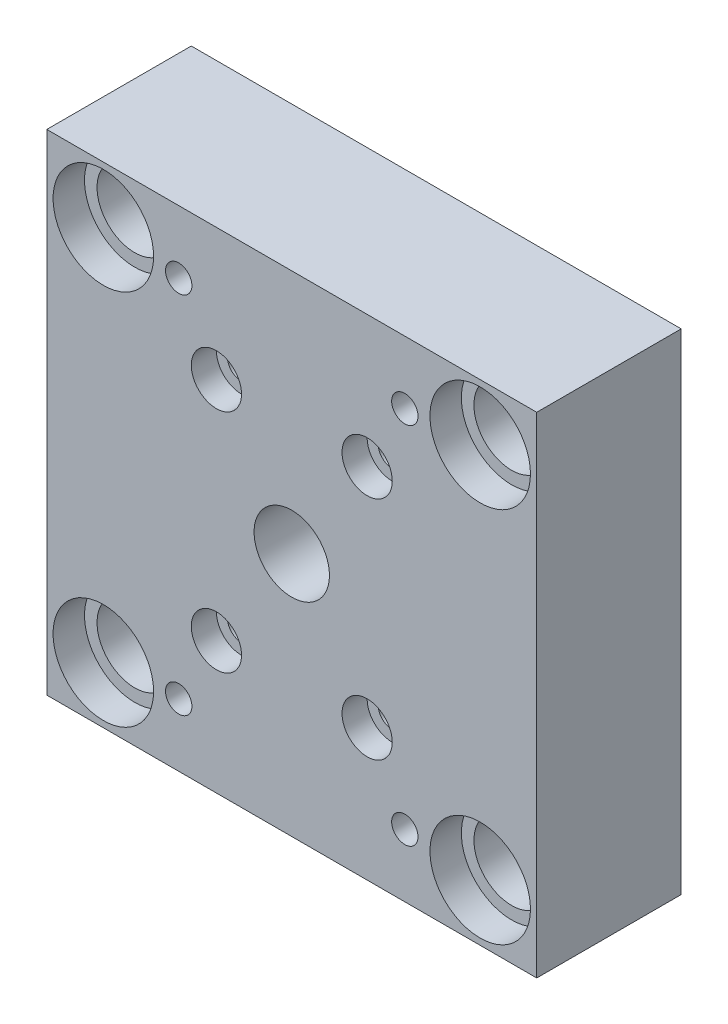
from build123d import *

# Parameters (mm, degrees)
ESQUISSE1_W                                        = 78
ESQUISSE1_H                                        = 78
EXTRUSION1_DEPTH                                   = 23
ESQUISSE5_R                                        = 6
ENL_V_MAT_EXTRU_1_DEPTH                            = 60.757844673
ESQUISSE6_R                                        = 8
ENL_V_MAT_EXTRU_2_DEPTH                            = 5
TROU_TARAUD_M5X0_81_D                              = 4.2
TROU_TARAUD_M5X0_81_DEPTH                          = 14
TROU_TARAUD_M5X0_81_TIP                            = 1.2618073
ESQUISSE9_R                                        = 6
ENL_V_MAT_EXTRU_3_DEPTH                            = 60.757844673
ENL_V_MAT_EXTRU_4_DEPTH                            = 12
CHAMBRAGE_POUR_VIS_T_TE_HEXAGONALE_M41_D           = 4.5
CHAMBRAGE_POUR_VIS_T_TE_HEXAGONALE_M41_CBORE_D     = 8
CHAMBRAGE_POUR_VIS_T_TE_HEXAGONALE_M41_CBORE_DEPTH = 4


with BuildPart() as part:
    # Esquisse1 → Extrusion1 (new body)
    with BuildSketch(Plane.XY):
        Rectangle(ESQUISSE1_W, ESQUISSE1_H)
    extrude(amount=EXTRUSION1_DEPTH)

    # Esquisse5 → Enl_v. mat.-Extru.1 (cut, through all)
    with BuildSketch(Plane.XY.offset(23)):
        with Locations((-30, 30)):
            Circle(ESQUISSE5_R)
        with Locations((30, 30)):
            Circle(ESQUISSE5_R)
        with Locations((30, -30)):
            Circle(ESQUISSE5_R)
        with Locations((-30, -30)):
            Circle(ESQUISSE5_R)
    extrude(amount=-ENL_V_MAT_EXTRU_1_DEPTH, mode=Mode.SUBTRACT)

    # Esquisse6 → Enl_v. mat.-Extru.2 (cut)
    with BuildSketch(Plane.XY.offset(23)):
        with Locations((30, 30)):
            Circle(ESQUISSE6_R)
        with Locations((-30, 30)):
            Circle(ESQUISSE6_R)
        with Locations((-30, -30)):
            Circle(ESQUISSE6_R)
        with Locations((30, -30)):
            Circle(ESQUISSE6_R)
    extrude(amount=-ENL_V_MAT_EXTRU_2_DEPTH, mode=Mode.SUBTRACT)

    # Trou taraud_ M5x0.81
    with Locations(Plane.XY.offset(23)):
        with Locations((18, 29), (-18, 29), (-18, -29), (18, -29)):
            Hole(TROU_TARAUD_M5X0_81_D / 2, depth=TROU_TARAUD_M5X0_81_DEPTH)
            with Locations((0, 0, -(TROU_TARAUD_M5X0_81_DEPTH + TROU_TARAUD_M5X0_81_TIP / 2))):  # 118° drill point
                Cone(0, TROU_TARAUD_M5X0_81_D / 2, TROU_TARAUD_M5X0_81_TIP, mode=Mode.SUBTRACT)

    # Esquisse9 → Enl_v. mat.-Extru.3 (cut, through all)
    with BuildSketch(Plane.XY.offset(23)):
        Circle(ESQUISSE9_R)
    extrude(amount=-ENL_V_MAT_EXTRU_3_DEPTH, mode=Mode.SUBTRACT)

    # Esquisse10 → Enl_v. mat.-Extru.4 (cut)
    with BuildSketch(Plane(origin=(0, 0, 0), x_dir=(-1, 0, 0), z_dir=(0, 0, -1))):
        with BuildLine():
            Line((-12, 24), (12, 24))
            ThreePointArc((12, 24), (16.242640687, 22.242640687), (18, 18))
            Line((18, 18), (18, -18))
            ThreePointArc((18, -18), (16.242640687, -22.242640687), (12, -24))
            Line((12, -24), (-12, -24))
            ThreePointArc((-12, -24), (-16.242640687, -22.242640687), (-18, -18))
            Line((-18, -18), (-18, 18))
            ThreePointArc((-18, 18), (-16.242640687, 22.242640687), (-12, 24))
        make_face()
    extrude(amount=-ENL_V_MAT_EXTRU_4_DEPTH, mode=Mode.SUBTRACT)

    # Chambrage pour vis _ t_te hexagonale M41 (through all)
    with Locations(Plane.XY.offset(23)):
        with Locations((12, 18), (-12, 18), (-12, -18), (12, -18)):
            CounterBoreHole(CHAMBRAGE_POUR_VIS_T_TE_HEXAGONALE_M41_D / 2, CHAMBRAGE_POUR_VIS_T_TE_HEXAGONALE_M41_CBORE_D / 2, CHAMBRAGE_POUR_VIS_T_TE_HEXAGONALE_M41_CBORE_DEPTH)


solid = part.part
